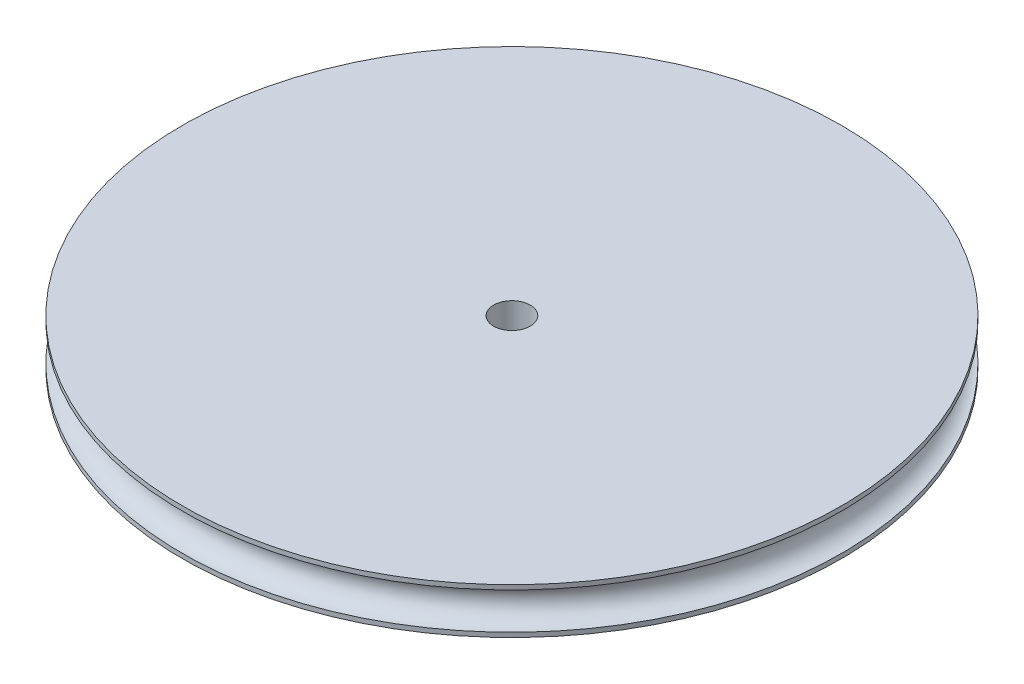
from build123d import *

# Parameters (mm, degrees)
CUT_EXTRUDE1_REACH = 83.211
SKETCH2_R          = 3.175


with BuildPart() as part:
    # Sketch1 → Revolve1 (revolve)
    with BuildSketch(Plane.XY, mode=Mode.PRIVATE) as revolve1_sk:
        with BuildLine():
            Line((57.15, 7.9375), (57.15, 7.14375))
            ThreePointArc((57.15, 7.14375), (53.975, 3.96875), (57.15, 0.79375))
            Line((57.15, 0.79375), (57.15, 0))
            Line((57.15, 0), (0, 0))
            Line((0, 0), (0, 7.9375))
            Line((0, 7.9375), (57.15, 7.9375))
        make_face()
    revolve(revolve1_sk.sketch.rotate(Axis((0, 0, 0), (0, 1, 0)), 90), axis=Axis((0, 0, 0), (0, 1, 0)))

    # Sketch2 → Cut-Extrude1 (cut, up to next)
    with BuildSketch(Plane(origin=(0, 7.9375, 0), x_dir=(1, 0, 0), z_dir=(0, 1, 0)), mode=Mode.PRIVATE) as cut_extrude1_sk1:
        with Locations(Location((0, 0, 0), (0, 0, 270))):
            Circle(SKETCH2_R)
    cut_extrude1_tool1 = extrude(cut_extrude1_sk1.sketch, amount=-CUT_EXTRUDE1_REACH, mode=Mode.PRIVATE) & part.part
    add(cut_extrude1_tool1.solids().sort_by_distance((0, 7.9375, 0))[0], mode=Mode.SUBTRACT)


solid = part.part
